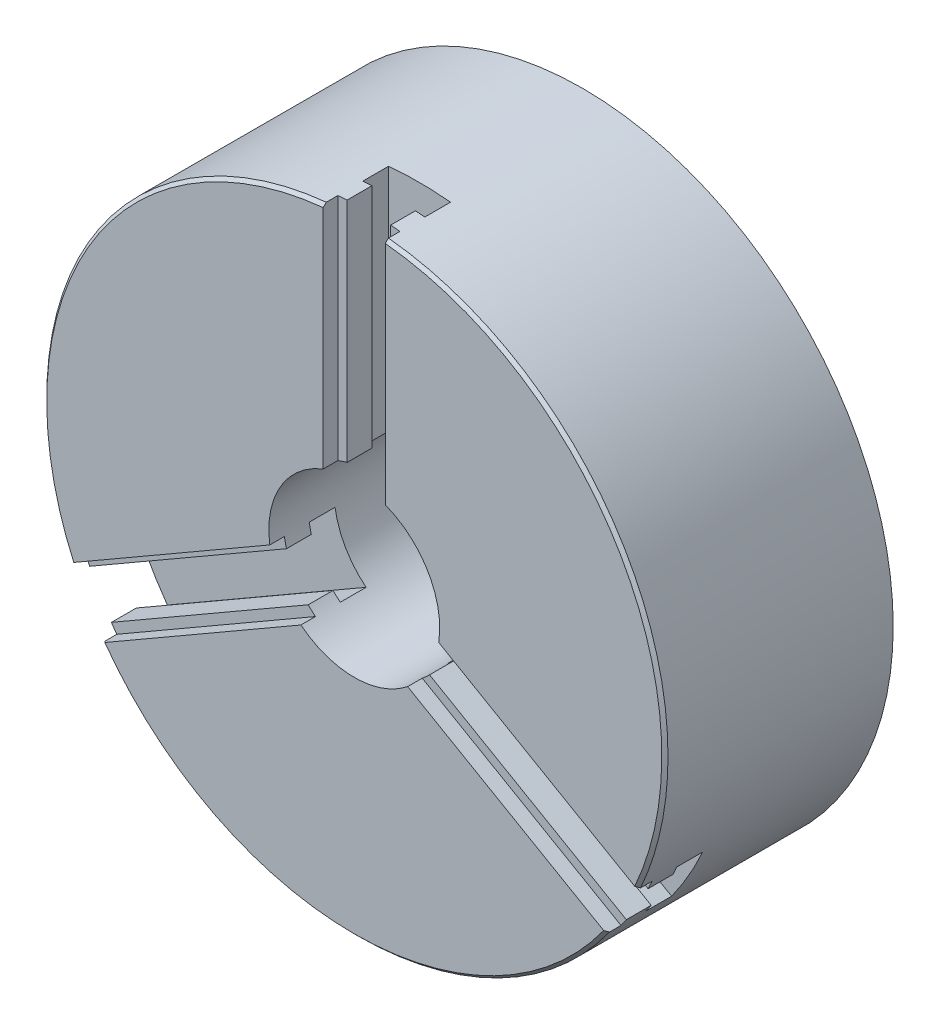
from build123d import *

# Parameters (mm, degrees)
ESQMANDRIN_R                 = 100
ESQMANDRIN_R_2               = 27.5
MANDRIN_DEPTH                = 73.5
GLISSIERE_REACH              = 161.381
R_P_TITION_CIRCULAIRE1_COUNT = 3
CHANFREIN1_SIZE              = 1
ESQUISSE1_R                  = 80
ENL_V_MAT_EXTRU_1_DEPTH      = 4


with BuildPart() as part:
    # EsqMandrin → Mandrin (new body)
    with BuildSketch(Plane.XY):
        Circle(ESQMANDRIN_R)
        with Locations(Location((0, 0, 0), (0, 0, 351.323686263))):
            Circle(ESQMANDRIN_R_2, mode=Mode.SUBTRACT)
    extrude(amount=-MANDRIN_DEPTH)

    # EsqGlissiere → Glissiere (cut, up to next)
    with BuildSketch(Plane(origin=(0, 0, 0), x_dir=(1, 0, 0), z_dir=(0, 1, 0)), mode=Mode.PRIVATE) as glissiere_sk1:
        Polygon((10, 12.7), (7, 12.7), (7, 4.7), (10, 4.7), (10, -10), (-10, -10), (-10, 4.7), (-7, 4.7), (-7, 12.7), (-10, 12.7), (-10, 21), (10, 21), align=None)
    glissiere_tool1 = extrude(glissiere_sk1.sketch, amount=GLISSIERE_REACH, mode=Mode.PRIVATE) & part.part
    glissiere = glissiere_tool1.solids().sort_by_distance((0, 0, -5.231469))[0]
    add(glissiere, mode=Mode.SUBTRACT)

    # R_p_tition circulaire1: Glissiere ×3 about axis
    r_p_tition_circulaire1_axis = Axis((0, 0, 54.48929561), (0, 0, -1))
    for i in range(1, R_P_TITION_CIRCULAIRE1_COUNT):
        add(glissiere.rotate(r_p_tition_circulaire1_axis, i * 360 / R_P_TITION_CIRCULAIRE1_COUNT), mode=Mode.SUBTRACT)

    # Chanfrein1
    chanfrein1_edges = [part.edges().sort_by_distance(p)[0] for p in [
        (74.161984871, 67.082039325, 0),
        (-86.602540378, 50, 0),
        (0, -100, 0),
        (97.767182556, -21.013757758, 0),
    ]]
    chamfer(chanfrein1_edges, length=CHANFREIN1_SIZE)

    # Esquisse1 → Enl_v. mat.-Extru.1 (cut)
    with BuildSketch(Plane(origin=(0, 0, -73.5), x_dir=(-1, 0, 0), z_dir=(0, 0, -1))):
        Circle(ESQUISSE1_R)
    extrude(amount=-ENL_V_MAT_EXTRU_1_DEPTH, mode=Mode.SUBTRACT)


solid = part.part
